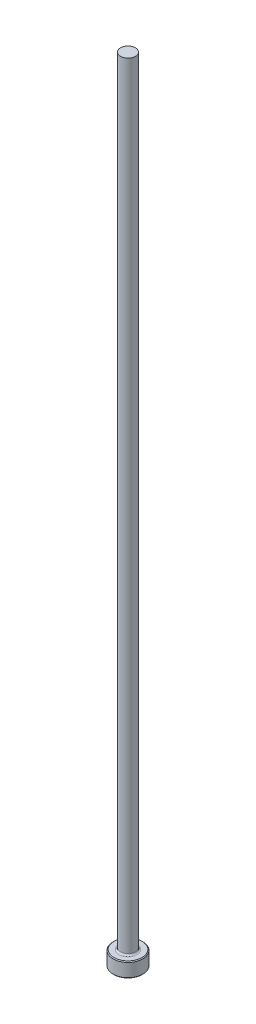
from build123d import *

# Parameters (mm, degrees)
CHAMFER1_SIZE = 0.254
FILLET1_R     = 0.508


with BuildPart() as part:
    # Sketch1 → Revolve1 (revolve)
    with BuildSketch(Plane.XY, mode=Mode.PRIVATE) as revolve1_sk:
        Polygon((0, 0), (-4.7625, 0), (-4.7625, 4.7498), (-2.38125, 4.7498), (-2.38125, 254), (0, 254), align=None)
    revolve(revolve1_sk.sketch.rotate(Axis((0, 259.958771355, 0), (0, -1, 0)), 270), axis=Axis((0, 259.958771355, 0), (0, -1, 0)))

    # Chamfer1
    chamfer1_edges = [part.edges().sort_by_distance(p)[0] for p in [
        (0, 4.7498, -4.7625),
        (0, 0, -4.7625),
    ]]
    chamfer(chamfer1_edges, length=CHAMFER1_SIZE)

    # Fillet1
    fillet1_edges = [part.edges().sort_by_distance(p)[0] for p in [
        (0, 4.7498, -2.38125),
    ]]
    fillet(fillet1_edges, radius=FILLET1_R)


solid = part.part
